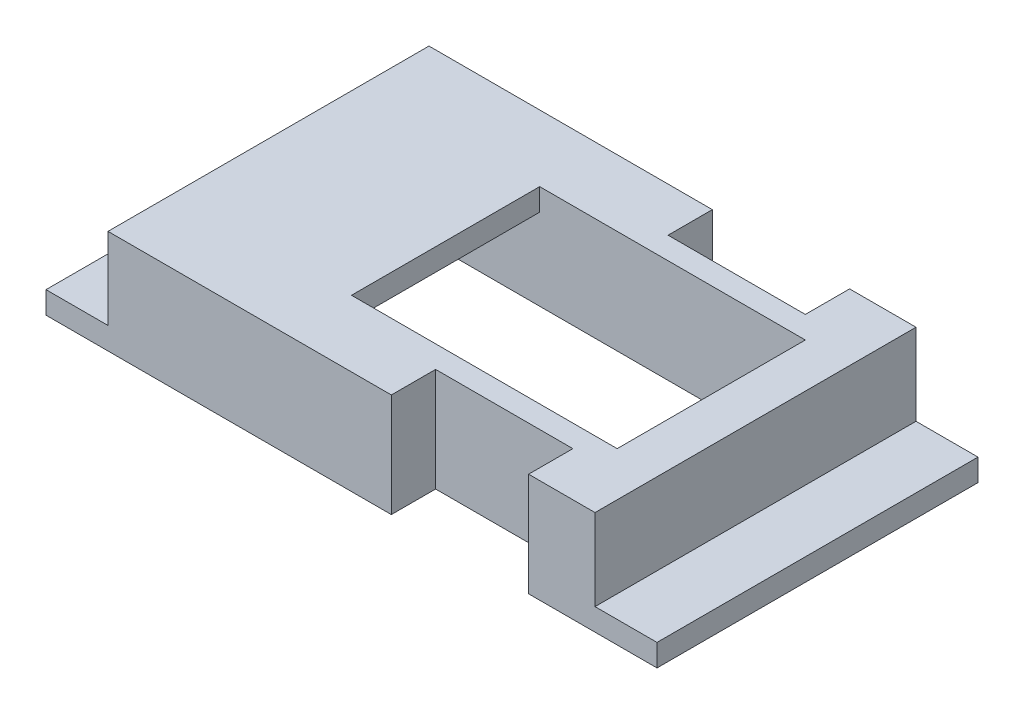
from build123d import *

# Parameters (mm, degrees)
BOSS_EXTRU_1_DEPTH      = 10.5
ESQUISSE3_W             = 20
ESQUISSE3_H             = 8.5
ENL_V_MAT_EXTRU_1_DEPTH = 10
ESQUISSE4_W             = 20
ESQUISSE4_H             = 1
BOSS_EXTRU_2_DEPTH      = 3.68029886
BOSS_EXTRU_8_DEPTH      = 2
BOSS_EXTRU_9_DEPTH      = 2
ESQUISSE5_W             = 8.5
ESQUISSE5_H             = 1
BOSS_EXTRU_3_DEPTH      = 7
ESQUISSE6_W             = 8.5
ESQUISSE6_H             = 1
BOSS_EXTRU_4_DEPTH      = 1
ESQUISSE23_W            = 6.2
ESQUISSE23_H            = 4.68029886
ENL_V_MAT_EXTRU_2_DEPTH = 2
ESQUISSE24_W            = 6.2
ESQUISSE24_H            = 4.68029886
ENL_V_MAT_EXTRU_3_DEPTH = 2


with BuildPart() as part:
    # Esquisse1 → Boss.-Extru.1 (new body)
    with BuildSketch(Plane.XY):
        Polygon((0, 19.881685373), (20, 19.881685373), (20, 16.201386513), (23.8, 16.201386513), (23.8, 17.201386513), (21, 17.201386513), (21, 20.881685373), (-1, 20.881685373), (-1, 17.201386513), (-3.8, 17.201386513), (-3.8, 16.201386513), (0, 16.201386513), align=None)
    extrude(amount=BOSS_EXTRU_1_DEPTH)

    # Esquisse3 → Enl_v. mat.-Extru.1 (cut)
    with BuildSketch(Plane.XZ.offset(-19.881685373)):
        with Locations((10, 5.25)):
            Rectangle(ESQUISSE3_W, ESQUISSE3_H)
    extrude(amount=-ENL_V_MAT_EXTRU_1_DEPTH, mode=Mode.SUBTRACT)

    # Esquisse4 → Boss.-Extru.2 (add)
    with BuildSketch(Plane.XZ.offset(-19.881685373)):
        with Locations((10, 0.5)):
            Rectangle(ESQUISSE4_W, ESQUISSE4_H)
        with Locations((10, 10)):
            Rectangle(ESQUISSE4_W, ESQUISSE4_H)
    extrude(amount=BOSS_EXTRU_2_DEPTH)

    # Esquisse14 → Boss.-Extru.8 (add)
    with BuildSketch(Plane.XY.offset(10.5)):
        Polygon((-3.8, 16.201386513), (23.8, 16.201386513), (23.8, 17.201386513), (21, 17.201386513), (21, 20.881685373), (-1, 20.881685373), (-1, 17.201386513), (-3.8, 17.201386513), align=None)
    extrude(amount=BOSS_EXTRU_8_DEPTH)

    # Esquisse15 → Boss.-Extru.9 (add)
    with BuildSketch(Plane(origin=(0, 0, 0), x_dir=(-1, 0, 0), z_dir=(0, 0, -1))):
        Polygon((1, 17.201386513), (1, 20.881685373), (-21, 20.881685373), (-21, 17.201386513), (-23.8, 17.201386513), (-23.8, 16.201386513), (3.8, 16.201386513), (3.8, 17.201386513), align=None)
    extrude(amount=BOSS_EXTRU_9_DEPTH)

    # Esquisse5 → Boss.-Extru.3 (add)
    with BuildSketch(Plane(origin=(0, 0, 0), x_dir=(0, 0, -1), z_dir=(1, 0, 0))):
        with Locations((-5.25, 20.381685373)):
            Rectangle(ESQUISSE5_W, ESQUISSE5_H)
    extrude(amount=BOSS_EXTRU_3_DEPTH)

    # Esquisse6 → Boss.-Extru.4 (add)
    with BuildSketch(Plane.ZY.offset(-20)):
        with Locations((5.25, 20.381685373)):
            Rectangle(ESQUISSE6_W, ESQUISSE6_H)
    extrude(amount=BOSS_EXTRU_4_DEPTH)

    # Esquisse23 → Enl_v. mat.-Extru.2 (cut)
    with BuildSketch(Plane.XY.offset(12.5)):
        with Locations((14.9, 18.541535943)):
            Rectangle(ESQUISSE23_W, ESQUISSE23_H)
    extrude(amount=-ENL_V_MAT_EXTRU_2_DEPTH, mode=Mode.SUBTRACT)

    # Esquisse24 → Enl_v. mat.-Extru.3 (cut)
    with BuildSketch(Plane(origin=(0, 0, -2), x_dir=(-1, 0, 0), z_dir=(0, 0, -1))):
        with Locations((-14.9, 18.541535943)):
            Rectangle(ESQUISSE24_W, ESQUISSE24_H)
    extrude(amount=-ENL_V_MAT_EXTRU_3_DEPTH, mode=Mode.SUBTRACT)


solid = part.part
